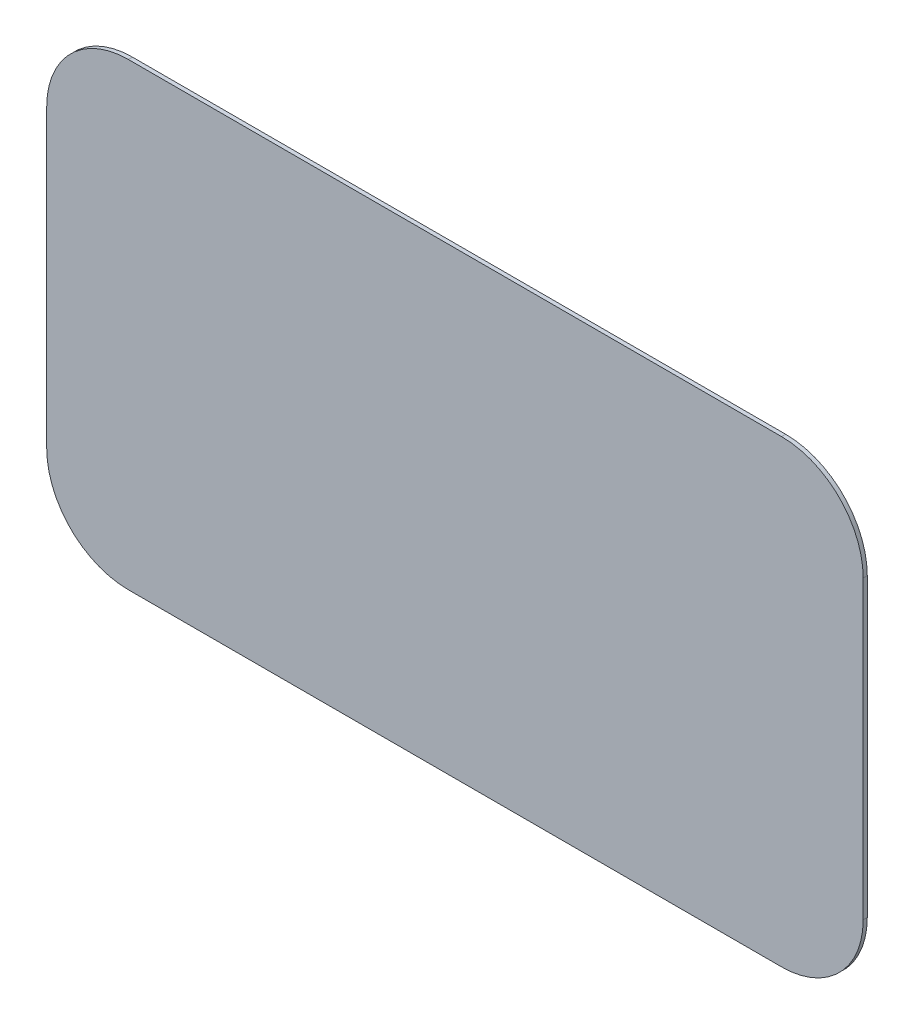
ISO-10303-21;
HEADER;
FILE_DESCRIPTION(('STEP AP214'),'2;1');
FILE_NAME('part.step','',(''),(''),'','','');
FILE_SCHEMA(('AUTOMOTIVE_DESIGN { 1 0 10303 214 1 1 1 1 }'));
ENDSEC;
DATA;
#1=APPLICATION_CONTEXT('core data for automotive mechanical design processes');
#2=APPLICATION_PROTOCOL_DEFINITION('international standard','automotive_design',2000,#1);
#3=PRODUCT_CONTEXT('',#1,'mechanical');
#4=PRODUCT('Part','Part','',(#3));
#5=PRODUCT_RELATED_PRODUCT_CATEGORY('part','',(#4));
#6=PRODUCT_DEFINITION_FORMATION('','',#4);
#7=PRODUCT_DEFINITION_CONTEXT('part definition',#1,'design');
#8=PRODUCT_DEFINITION('design','',#6,#7);
#9=PRODUCT_DEFINITION_SHAPE('','',#8);
#10=(LENGTH_UNIT() NAMED_UNIT(*) SI_UNIT(.MILLI.,.METRE.));
#11=(NAMED_UNIT(*) PLANE_ANGLE_UNIT() SI_UNIT($,.RADIAN.));
#12=(NAMED_UNIT(*) SI_UNIT($,.STERADIAN.) SOLID_ANGLE_UNIT());
#13=UNCERTAINTY_MEASURE_WITH_UNIT(LENGTH_MEASURE(1.E-05),#10,'distance_accuracy_value','');
#14=(GEOMETRIC_REPRESENTATION_CONTEXT(3) GLOBAL_UNCERTAINTY_ASSIGNED_CONTEXT((#13)) GLOBAL_UNIT_ASSIGNED_CONTEXT((#10,
#11,#12)) REPRESENTATION_CONTEXT('',''));
#15=CARTESIAN_POINT('',(0.,0.,0.));
#16=DIRECTION('',(0.,0.,1.));
#17=DIRECTION('',(1.,0.,0.));
#18=AXIS2_PLACEMENT_3D('',#15,#16,#17);
#19=CARTESIAN_POINT('',(10.,5.625,0.1));
#20=DIRECTION('',(-1.,0.,0.));
#21=DIRECTION('',(0.,0.,1.));
#22=AXIS2_PLACEMENT_3D('',#19,#20,#21);
#23=PLANE('',#22);
#24=DIRECTION('',(0.,1.,0.));
#25=VECTOR('',#24,1.);
#26=CARTESIAN_POINT('',(10.,5.625,0.1));
#27=LINE('',#26,#25);
#28=CARTESIAN_POINT('',(10.,-3.625,0.1));
#29=VERTEX_POINT('',#28);
#30=CARTESIAN_POINT('',(10.,3.625,0.1));
#31=VERTEX_POINT('',#30);
#32=EDGE_CURVE('E130',#29,#31,#27,.T.);
#33=ORIENTED_EDGE('',*,*,#32,.F.);
#34=DIRECTION('',(0.,0.,-1.));
#35=VECTOR('',#34,1.);
#36=CARTESIAN_POINT('',(10.,-3.625,0.1));
#37=LINE('',#36,#35);
#38=CARTESIAN_POINT('',(10.,-3.625,0.));
#39=VERTEX_POINT('',#38);
#40=EDGE_CURVE('E11',#29,#39,#37,.T.);
#41=ORIENTED_EDGE('',*,*,#40,.T.);
#42=DIRECTION('',(0.,1.,0.));
#43=VECTOR('',#42,1.);
#44=CARTESIAN_POINT('',(10.,5.625,0.));
#45=LINE('',#44,#43);
#46=CARTESIAN_POINT('',(10.,3.625,0.));
#47=VERTEX_POINT('',#46);
#48=EDGE_CURVE('E161',#39,#47,#45,.T.);
#49=ORIENTED_EDGE('',*,*,#48,.T.);
#50=DIRECTION('',(0.,0.,-1.));
#51=VECTOR('',#50,1.);
#52=CARTESIAN_POINT('',(10.,3.625,0.1));
#53=LINE('',#52,#51);
#54=EDGE_CURVE('E44',#47,#31,#53,.F.);
#55=ORIENTED_EDGE('',*,*,#54,.T.);
#56=EDGE_LOOP('',(#33,#41,#49,#55));
#57=FACE_BOUND('',#56,.T.);
#58=ADVANCED_FACE('F36',(#57),#23,.F.);
#59=CARTESIAN_POINT('',(-10.,5.625,0.1));
#60=DIRECTION('',(0.,-1.,0.));
#61=DIRECTION('',(0.,0.,-1.));
#62=AXIS2_PLACEMENT_3D('',#59,#60,#61);
#63=PLANE('',#62);
#64=DIRECTION('',(-1.,0.,0.));
#65=VECTOR('',#64,1.);
#66=CARTESIAN_POINT('',(-10.,5.625,0.));
#67=LINE('',#66,#65);
#68=CARTESIAN_POINT('',(8.,5.625,0.));
#69=VERTEX_POINT('',#68);
#70=CARTESIAN_POINT('',(-8.,5.625,0.));
#71=VERTEX_POINT('',#70);
#72=EDGE_CURVE('E135',#69,#71,#67,.T.);
#73=ORIENTED_EDGE('',*,*,#72,.T.);
#74=DIRECTION('',(0.,0.,-1.));
#75=VECTOR('',#74,1.);
#76=CARTESIAN_POINT('',(-8.,5.625,0.1));
#77=LINE('',#76,#75);
#78=CARTESIAN_POINT('',(-8.,5.625,0.1));
#79=VERTEX_POINT('',#78);
#80=EDGE_CURVE('E51',#71,#79,#77,.F.);
#81=ORIENTED_EDGE('',*,*,#80,.T.);
#82=DIRECTION('',(-1.,0.,0.));
#83=VECTOR('',#82,1.);
#84=CARTESIAN_POINT('',(-10.,5.625,0.1));
#85=LINE('',#84,#83);
#86=CARTESIAN_POINT('',(8.,5.625,0.1));
#87=VERTEX_POINT('',#86);
#88=EDGE_CURVE('E133',#87,#79,#85,.T.);
#89=ORIENTED_EDGE('',*,*,#88,.F.);
#90=DIRECTION('',(0.,0.,-1.));
#91=VECTOR('',#90,1.);
#92=CARTESIAN_POINT('',(8.,5.625,0.1));
#93=LINE('',#92,#91);
#94=EDGE_CURVE('E153',#87,#69,#93,.T.);
#95=ORIENTED_EDGE('',*,*,#94,.T.);
#96=EDGE_LOOP('',(#73,#81,#89,#95));
#97=FACE_BOUND('',#96,.T.);
#98=ADVANCED_FACE('F168',(#97),#63,.F.);
#99=CARTESIAN_POINT('',(-10.,5.625,0.1));
#100=DIRECTION('',(1.,0.,0.));
#101=DIRECTION('',(0.,0.,-1.));
#102=AXIS2_PLACEMENT_3D('',#99,#100,#101);
#103=PLANE('',#102);
#104=DIRECTION('',(0.,-1.,0.));
#105=VECTOR('',#104,1.);
#106=CARTESIAN_POINT('',(-10.,5.625,0.));
#107=LINE('',#106,#105);
#108=CARTESIAN_POINT('',(-10.,3.625,0.));
#109=VERTEX_POINT('',#108);
#110=CARTESIAN_POINT('',(-10.,-3.625,0.));
#111=VERTEX_POINT('',#110);
#112=EDGE_CURVE('E131',#109,#111,#107,.T.);
#113=ORIENTED_EDGE('',*,*,#112,.T.);
#114=DIRECTION('',(0.,0.,-1.));
#115=VECTOR('',#114,1.);
#116=CARTESIAN_POINT('',(-10.,-3.625,0.1));
#117=LINE('',#116,#115);
#118=CARTESIAN_POINT('',(-10.,-3.625,0.1));
#119=VERTEX_POINT('',#118);
#120=EDGE_CURVE('E108',#111,#119,#117,.F.);
#121=ORIENTED_EDGE('',*,*,#120,.T.);
#122=DIRECTION('',(0.,-1.,0.));
#123=VECTOR('',#122,1.);
#124=CARTESIAN_POINT('',(-10.,5.625,0.1));
#125=LINE('',#124,#123);
#126=CARTESIAN_POINT('',(-10.,3.625,0.1));
#127=VERTEX_POINT('',#126);
#128=EDGE_CURVE('E172',#127,#119,#125,.T.);
#129=ORIENTED_EDGE('',*,*,#128,.F.);
#130=DIRECTION('',(0.,0.,-1.));
#131=VECTOR('',#130,1.);
#132=CARTESIAN_POINT('',(-10.,3.625,0.1));
#133=LINE('',#132,#131);
#134=EDGE_CURVE('E113',#127,#109,#133,.T.);
#135=ORIENTED_EDGE('',*,*,#134,.T.);
#136=EDGE_LOOP('',(#113,#121,#129,#135));
#137=FACE_BOUND('',#136,.T.);
#138=ADVANCED_FACE('F180',(#137),#103,.F.);
#139=CARTESIAN_POINT('',(-10.,-5.625,0.1));
#140=DIRECTION('',(0.,1.,0.));
#141=DIRECTION('',(0.,0.,1.));
#142=AXIS2_PLACEMENT_3D('',#139,#140,#141);
#143=PLANE('',#142);
#144=DIRECTION('',(1.,0.,0.));
#145=VECTOR('',#144,1.);
#146=CARTESIAN_POINT('',(-10.,-5.625,0.1));
#147=LINE('',#146,#145);
#148=CARTESIAN_POINT('',(-8.,-5.625,0.1));
#149=VERTEX_POINT('',#148);
#150=CARTESIAN_POINT('',(8.,-5.625,0.1));
#151=VERTEX_POINT('',#150);
#152=EDGE_CURVE('E123',#149,#151,#147,.T.);
#153=ORIENTED_EDGE('',*,*,#152,.F.);
#154=DIRECTION('',(0.,0.,-1.));
#155=VECTOR('',#154,1.);
#156=CARTESIAN_POINT('',(-8.,-5.625,0.1));
#157=LINE('',#156,#155);
#158=CARTESIAN_POINT('',(-8.,-5.625,0.));
#159=VERTEX_POINT('',#158);
#160=EDGE_CURVE('E107',#149,#159,#157,.T.);
#161=ORIENTED_EDGE('',*,*,#160,.T.);
#162=DIRECTION('',(1.,0.,0.));
#163=VECTOR('',#162,1.);
#164=CARTESIAN_POINT('',(-10.,-5.625,0.));
#165=LINE('',#164,#163);
#166=CARTESIAN_POINT('',(8.,-5.625,0.));
#167=VERTEX_POINT('',#166);
#168=EDGE_CURVE('E120',#159,#167,#165,.T.);
#169=ORIENTED_EDGE('',*,*,#168,.T.);
#170=DIRECTION('',(0.,0.,-1.));
#171=VECTOR('',#170,1.);
#172=CARTESIAN_POINT('',(8.,-5.625,0.1));
#173=LINE('',#172,#171);
#174=EDGE_CURVE('E125',#167,#151,#173,.F.);
#175=ORIENTED_EDGE('',*,*,#174,.T.);
#176=EDGE_LOOP('',(#153,#161,#169,#175));
#177=FACE_BOUND('',#176,.T.);
#178=ADVANCED_FACE('F119',(#177),#143,.F.);
#179=CARTESIAN_POINT('',(0.,0.,0.1));
#180=DIRECTION('',(0.,0.,1.));
#181=DIRECTION('',(1.,0.,0.));
#182=AXIS2_PLACEMENT_3D('',#179,#180,#181);
#183=PLANE('',#182);
#184=ORIENTED_EDGE('',*,*,#128,.T.);
#185=CARTESIAN_POINT('',(-8.,-3.625,0.1));
#186=DIRECTION('',(0.,0.,1.));
#187=DIRECTION('',(1.,0.,0.));
#188=AXIS2_PLACEMENT_3D('',#185,#186,#187);
#189=CIRCLE('',#188,2.);
#190=EDGE_CURVE('E151',#119,#149,#189,.T.);
#191=ORIENTED_EDGE('',*,*,#190,.T.);
#192=ORIENTED_EDGE('',*,*,#152,.T.);
#193=CARTESIAN_POINT('',(8.,-3.625,0.1));
#194=DIRECTION('',(0.,0.,1.));
#195=DIRECTION('',(1.,0.,0.));
#196=AXIS2_PLACEMENT_3D('',#193,#194,#195);
#197=CIRCLE('',#196,2.);
#198=EDGE_CURVE('E147',#151,#29,#197,.T.);
#199=ORIENTED_EDGE('',*,*,#198,.T.);
#200=ORIENTED_EDGE('',*,*,#32,.T.);
#201=CARTESIAN_POINT('',(8.,3.625,0.1));
#202=DIRECTION('',(0.,0.,1.));
#203=DIRECTION('',(1.,0.,0.));
#204=AXIS2_PLACEMENT_3D('',#201,#202,#203);
#205=CIRCLE('',#204,2.);
#206=EDGE_CURVE('E58',#31,#87,#205,.T.);
#207=ORIENTED_EDGE('',*,*,#206,.T.);
#208=ORIENTED_EDGE('',*,*,#88,.T.);
#209=CARTESIAN_POINT('',(-8.,3.625,0.1));
#210=DIRECTION('',(0.,0.,1.));
#211=DIRECTION('',(1.,0.,0.));
#212=AXIS2_PLACEMENT_3D('',#209,#210,#211);
#213=CIRCLE('',#212,2.);
#214=EDGE_CURVE('E149',#79,#127,#213,.T.);
#215=ORIENTED_EDGE('',*,*,#214,.T.);
#216=EDGE_LOOP('',(#184,#191,#192,#199,#200,#207,#208,#215));
#217=FACE_BOUND('',#216,.T.);
#218=ADVANCED_FACE('F164',(#217),#183,.T.);
#219=CARTESIAN_POINT('',(0.,0.,0.));
#220=DIRECTION('',(0.,0.,1.));
#221=DIRECTION('',(1.,0.,0.));
#222=AXIS2_PLACEMENT_3D('',#219,#220,#221);
#223=PLANE('',#222);
#224=ORIENTED_EDGE('',*,*,#168,.F.);
#225=CARTESIAN_POINT('',(-8.,-3.625,0.));
#226=DIRECTION('',(0.,0.,1.));
#227=DIRECTION('',(1.,0.,0.));
#228=AXIS2_PLACEMENT_3D('',#225,#226,#227);
#229=CIRCLE('',#228,2.);
#230=EDGE_CURVE('E103',#159,#111,#229,.F.);
#231=ORIENTED_EDGE('',*,*,#230,.T.);
#232=ORIENTED_EDGE('',*,*,#112,.F.);
#233=CARTESIAN_POINT('',(-8.,3.625,0.));
#234=DIRECTION('',(0.,0.,1.));
#235=DIRECTION('',(1.,0.,0.));
#236=AXIS2_PLACEMENT_3D('',#233,#234,#235);
#237=CIRCLE('',#236,2.);
#238=EDGE_CURVE('E114',#109,#71,#237,.F.);
#239=ORIENTED_EDGE('',*,*,#238,.T.);
#240=ORIENTED_EDGE('',*,*,#72,.F.);
#241=CARTESIAN_POINT('',(8.,3.625,0.));
#242=DIRECTION('',(0.,0.,1.));
#243=DIRECTION('',(1.,0.,0.));
#244=AXIS2_PLACEMENT_3D('',#241,#242,#243);
#245=CIRCLE('',#244,2.);
#246=EDGE_CURVE('E124',#69,#47,#245,.F.);
#247=ORIENTED_EDGE('',*,*,#246,.T.);
#248=ORIENTED_EDGE('',*,*,#48,.F.);
#249=CARTESIAN_POINT('',(8.,-3.625,0.));
#250=DIRECTION('',(0.,0.,1.));
#251=DIRECTION('',(1.,0.,0.));
#252=AXIS2_PLACEMENT_3D('',#249,#250,#251);
#253=CIRCLE('',#252,2.);
#254=EDGE_CURVE('E129',#39,#167,#253,.F.);
#255=ORIENTED_EDGE('',*,*,#254,.T.);
#256=EDGE_LOOP('',(#224,#231,#232,#239,#240,#247,#248,#255));
#257=FACE_BOUND('',#256,.T.);
#258=ADVANCED_FACE('F127',(#257),#223,.F.);
#259=CARTESIAN_POINT('',(-8.,-3.625,0.1));
#260=DIRECTION('',(0.,0.,-1.));
#261=DIRECTION('',(-1.,0.,0.));
#262=AXIS2_PLACEMENT_3D('',#259,#260,#261);
#263=CYLINDRICAL_SURFACE('',#262,2.);
#264=ORIENTED_EDGE('',*,*,#190,.F.);
#265=ORIENTED_EDGE('',*,*,#120,.F.);
#266=ORIENTED_EDGE('',*,*,#230,.F.);
#267=ORIENTED_EDGE('',*,*,#160,.F.);
#268=EDGE_LOOP('',(#264,#265,#266,#267));
#269=FACE_BOUND('',#268,.T.);
#270=ADVANCED_FACE('F106',(#269),#263,.T.);
#271=CARTESIAN_POINT('',(-8.,3.625,0.1));
#272=DIRECTION('',(0.,0.,-1.));
#273=DIRECTION('',(-1.,0.,0.));
#274=AXIS2_PLACEMENT_3D('',#271,#272,#273);
#275=CYLINDRICAL_SURFACE('',#274,2.);
#276=ORIENTED_EDGE('',*,*,#214,.F.);
#277=ORIENTED_EDGE('',*,*,#80,.F.);
#278=ORIENTED_EDGE('',*,*,#238,.F.);
#279=ORIENTED_EDGE('',*,*,#134,.F.);
#280=EDGE_LOOP('',(#276,#277,#278,#279));
#281=FACE_BOUND('',#280,.T.);
#282=ADVANCED_FACE('F178',(#281),#275,.T.);
#283=CARTESIAN_POINT('',(8.,-3.625,0.1));
#284=DIRECTION('',(0.,0.,-1.));
#285=DIRECTION('',(-1.,0.,0.));
#286=AXIS2_PLACEMENT_3D('',#283,#284,#285);
#287=CYLINDRICAL_SURFACE('',#286,2.);
#288=ORIENTED_EDGE('',*,*,#198,.F.);
#289=ORIENTED_EDGE('',*,*,#174,.F.);
#290=ORIENTED_EDGE('',*,*,#254,.F.);
#291=ORIENTED_EDGE('',*,*,#40,.F.);
#292=EDGE_LOOP('',(#288,#289,#290,#291));
#293=FACE_BOUND('',#292,.T.);
#294=ADVANCED_FACE('F182',(#293),#287,.T.);
#295=CARTESIAN_POINT('',(8.,3.625,0.1));
#296=DIRECTION('',(0.,0.,-1.));
#297=DIRECTION('',(-1.,0.,0.));
#298=AXIS2_PLACEMENT_3D('',#295,#296,#297);
#299=CYLINDRICAL_SURFACE('',#298,2.);
#300=ORIENTED_EDGE('',*,*,#206,.F.);
#301=ORIENTED_EDGE('',*,*,#54,.F.);
#302=ORIENTED_EDGE('',*,*,#246,.F.);
#303=ORIENTED_EDGE('',*,*,#94,.F.);
#304=EDGE_LOOP('',(#300,#301,#302,#303));
#305=FACE_BOUND('',#304,.T.);
#306=ADVANCED_FACE('F38',(#305),#299,.T.);
#307=CLOSED_SHELL('',(#58,#98,#138,#178,#218,#258,#270,#282,#294,#306));
#308=MANIFOLD_SOLID_BREP('B2',#307);
#309=ADVANCED_BREP_SHAPE_REPRESENTATION('',(#18,#308),#14);
#310=SHAPE_DEFINITION_REPRESENTATION(#9,#309);
ENDSEC;
END-ISO-10303-21;
